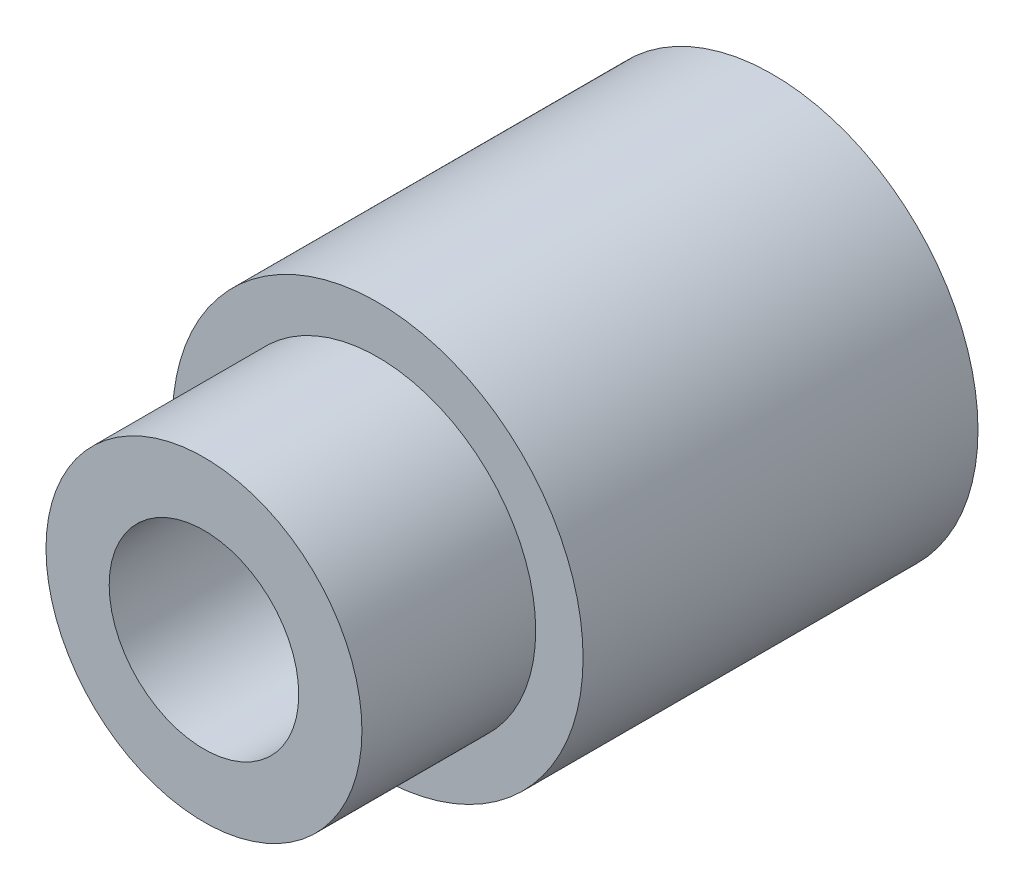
ISO-10303-21;
HEADER;
FILE_DESCRIPTION(('STEP AP214'),'2;1');
FILE_NAME('part.step','',(''),(''),'','','');
FILE_SCHEMA(('AUTOMOTIVE_DESIGN { 1 0 10303 214 1 1 1 1 }'));
ENDSEC;
DATA;
#1=APPLICATION_CONTEXT('core data for automotive mechanical design processes');
#2=APPLICATION_PROTOCOL_DEFINITION('international standard','automotive_design',2000,#1);
#3=PRODUCT_CONTEXT('',#1,'mechanical');
#4=PRODUCT('Part','Part','',(#3));
#5=PRODUCT_RELATED_PRODUCT_CATEGORY('part','',(#4));
#6=PRODUCT_DEFINITION_FORMATION('','',#4);
#7=PRODUCT_DEFINITION_CONTEXT('part definition',#1,'design');
#8=PRODUCT_DEFINITION('design','',#6,#7);
#9=PRODUCT_DEFINITION_SHAPE('','',#8);
#10=(LENGTH_UNIT() NAMED_UNIT(*) SI_UNIT(.MILLI.,.METRE.));
#11=(NAMED_UNIT(*) PLANE_ANGLE_UNIT() SI_UNIT($,.RADIAN.));
#12=(NAMED_UNIT(*) SI_UNIT($,.STERADIAN.) SOLID_ANGLE_UNIT());
#13=UNCERTAINTY_MEASURE_WITH_UNIT(LENGTH_MEASURE(1.E-05),#10,'distance_accuracy_value','');
#14=(GEOMETRIC_REPRESENTATION_CONTEXT(3) GLOBAL_UNCERTAINTY_ASSIGNED_CONTEXT((#13)) GLOBAL_UNIT_ASSIGNED_CONTEXT((#10,
#11,#12)) REPRESENTATION_CONTEXT('',''));
#15=CARTESIAN_POINT('',(0.,0.,0.));
#16=DIRECTION('',(0.,0.,1.));
#17=DIRECTION('',(1.,0.,0.));
#18=AXIS2_PLACEMENT_3D('',#15,#16,#17);
#19=CARTESIAN_POINT('',(0.,0.,-25.));
#20=DIRECTION('',(0.,0.,1.));
#21=DIRECTION('',(1.,0.,0.));
#22=AXIS2_PLACEMENT_3D('',#19,#20,#21);
#23=CYLINDRICAL_SURFACE('',#22,6.);
#24=CARTESIAN_POINT('',(0.,0.,-25.));
#25=DIRECTION('',(0.,0.,1.));
#26=DIRECTION('',(1.,0.,0.));
#27=AXIS2_PLACEMENT_3D('',#24,#25,#26);
#28=CIRCLE('',#27,6.);
#29=CARTESIAN_POINT('',(6.,0.,-25.));
#30=VERTEX_POINT('',#29);
#31=EDGE_CURVE('E52',#30,#30,#28,.T.);
#32=ORIENTED_EDGE('',*,*,#31,.F.);
#33=EDGE_LOOP('',(#32));
#34=FACE_BOUND('',#33,.T.);
#35=CARTESIAN_POINT('',(0.,0.,11.));
#36=DIRECTION('',(0.,0.,1.));
#37=DIRECTION('',(1.,0.,0.));
#38=AXIS2_PLACEMENT_3D('',#35,#36,#37);
#39=CIRCLE('',#38,6.);
#40=CARTESIAN_POINT('',(6.,0.,11.));
#41=VERTEX_POINT('',#40);
#42=EDGE_CURVE('E46',#41,#41,#39,.F.);
#43=ORIENTED_EDGE('',*,*,#42,.F.);
#44=EDGE_LOOP('',(#43));
#45=FACE_BOUND('',#44,.T.);
#46=ADVANCED_FACE('F14',(#34,#45),#23,.F.);
#47=CARTESIAN_POINT('',(13.,-13.,-25.));
#48=DIRECTION('',(0.,0.,-1.));
#49=DIRECTION('',(-1.,0.,0.));
#50=AXIS2_PLACEMENT_3D('',#47,#48,#49);
#51=PLANE('',#50);
#52=ORIENTED_EDGE('',*,*,#31,.T.);
#53=EDGE_LOOP('',(#52));
#54=FACE_BOUND('',#53,.T.);
#55=CARTESIAN_POINT('',(0.,0.,-25.));
#56=DIRECTION('',(0.,0.,1.));
#57=DIRECTION('',(1.,0.,0.));
#58=AXIS2_PLACEMENT_3D('',#55,#56,#57);
#59=CIRCLE('',#58,13.);
#60=CARTESIAN_POINT('',(13.,0.,-25.));
#61=VERTEX_POINT('',#60);
#62=EDGE_CURVE('E41',#61,#61,#59,.F.);
#63=ORIENTED_EDGE('',*,*,#62,.T.);
#64=EDGE_LOOP('',(#63));
#65=FACE_BOUND('',#64,.T.);
#66=ADVANCED_FACE('F58',(#54,#65),#51,.T.);
#67=CARTESIAN_POINT('',(-10.,-10.,11.));
#68=DIRECTION('',(0.,0.,1.));
#69=DIRECTION('',(1.,0.,0.));
#70=AXIS2_PLACEMENT_3D('',#67,#68,#69);
#71=PLANE('',#70);
#72=ORIENTED_EDGE('',*,*,#42,.T.);
#73=EDGE_LOOP('',(#72));
#74=FACE_BOUND('',#73,.T.);
#75=CARTESIAN_POINT('',(0.,0.,11.));
#76=DIRECTION('',(0.,0.,1.));
#77=DIRECTION('',(1.,0.,0.));
#78=AXIS2_PLACEMENT_3D('',#75,#76,#77);
#79=CIRCLE('',#78,10.);
#80=CARTESIAN_POINT('',(10.,0.,11.));
#81=VERTEX_POINT('',#80);
#82=EDGE_CURVE('E32',#81,#81,#79,.T.);
#83=ORIENTED_EDGE('',*,*,#82,.T.);
#84=EDGE_LOOP('',(#83));
#85=FACE_BOUND('',#84,.T.);
#86=ADVANCED_FACE('F66',(#74,#85),#71,.T.);
#87=CARTESIAN_POINT('',(0.,0.,-25.));
#88=DIRECTION('',(0.,0.,1.));
#89=DIRECTION('',(1.,0.,0.));
#90=AXIS2_PLACEMENT_3D('',#87,#88,#89);
#91=CYLINDRICAL_SURFACE('',#90,13.);
#92=ORIENTED_EDGE('',*,*,#62,.F.);
#93=EDGE_LOOP('',(#92));
#94=FACE_BOUND('',#93,.T.);
#95=CARTESIAN_POINT('',(0.,0.,0.));
#96=DIRECTION('',(0.,0.,1.));
#97=DIRECTION('',(1.,0.,0.));
#98=AXIS2_PLACEMENT_3D('',#95,#96,#97);
#99=CIRCLE('',#98,13.);
#100=CARTESIAN_POINT('',(13.,0.,0.));
#101=VERTEX_POINT('',#100);
#102=EDGE_CURVE('E23',#101,#101,#99,.T.);
#103=ORIENTED_EDGE('',*,*,#102,.F.);
#104=EDGE_LOOP('',(#103));
#105=FACE_BOUND('',#104,.T.);
#106=ADVANCED_FACE('F69',(#94,#105),#91,.T.);
#107=CARTESIAN_POINT('',(0.,0.,0.));
#108=DIRECTION('',(0.,0.,1.));
#109=DIRECTION('',(1.,0.,0.));
#110=AXIS2_PLACEMENT_3D('',#107,#108,#109);
#111=CYLINDRICAL_SURFACE('',#110,10.);
#112=CARTESIAN_POINT('',(0.,0.,0.));
#113=DIRECTION('',(0.,0.,1.));
#114=DIRECTION('',(1.,0.,0.));
#115=AXIS2_PLACEMENT_3D('',#112,#113,#114);
#116=CIRCLE('',#115,10.);
#117=CARTESIAN_POINT('',(10.,0.,0.));
#118=VERTEX_POINT('',#117);
#119=EDGE_CURVE('E10',#118,#118,#116,.F.);
#120=ORIENTED_EDGE('',*,*,#119,.F.);
#121=EDGE_LOOP('',(#120));
#122=FACE_BOUND('',#121,.T.);
#123=ORIENTED_EDGE('',*,*,#82,.F.);
#124=EDGE_LOOP('',(#123));
#125=FACE_BOUND('',#124,.T.);
#126=ADVANCED_FACE('F72',(#122,#125),#111,.T.);
#127=CARTESIAN_POINT('',(-13.,-13.,0.));
#128=DIRECTION('',(0.,0.,1.));
#129=DIRECTION('',(1.,0.,0.));
#130=AXIS2_PLACEMENT_3D('',#127,#128,#129);
#131=PLANE('',#130);
#132=ORIENTED_EDGE('',*,*,#119,.T.);
#133=EDGE_LOOP('',(#132));
#134=FACE_BOUND('',#133,.T.);
#135=ORIENTED_EDGE('',*,*,#102,.T.);
#136=EDGE_LOOP('',(#135));
#137=FACE_BOUND('',#136,.T.);
#138=ADVANCED_FACE('F16',(#134,#137),#131,.T.);
#139=CLOSED_SHELL('',(#46,#66,#86,#106,#126,#138));
#140=MANIFOLD_SOLID_BREP('B1',#139);
#141=ADVANCED_BREP_SHAPE_REPRESENTATION('',(#18,#140),#14);
#142=SHAPE_DEFINITION_REPRESENTATION(#9,#141);
ENDSEC;
END-ISO-10303-21;
